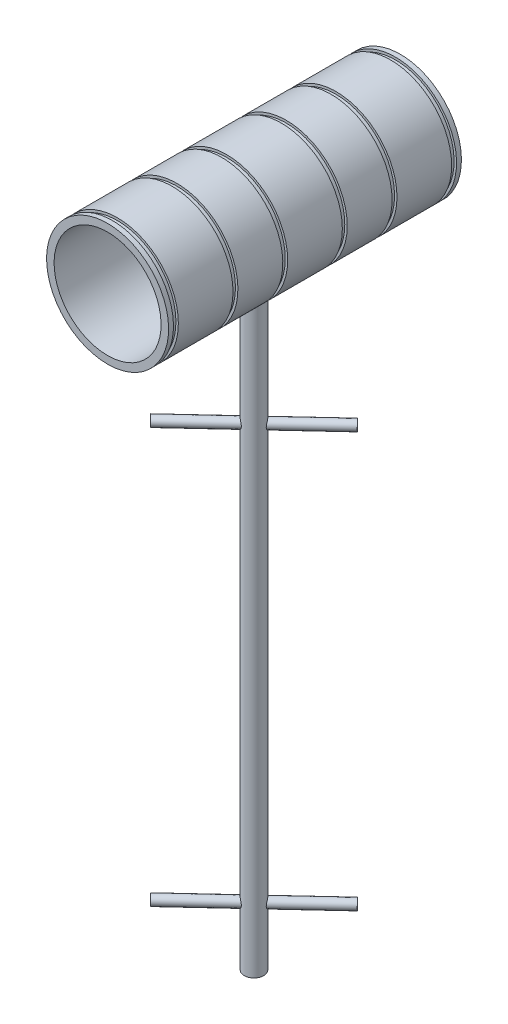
ISO-10303-21;
HEADER;
FILE_DESCRIPTION(('STEP AP214'),'2;1');
FILE_NAME('part.step','',(''),(''),'','','');
FILE_SCHEMA(('AUTOMOTIVE_DESIGN { 1 0 10303 214 1 1 1 1 }'));
ENDSEC;
DATA;
#1=APPLICATION_CONTEXT('core data for automotive mechanical design processes');
#2=APPLICATION_PROTOCOL_DEFINITION('international standard','automotive_design',2000,#1);
#3=PRODUCT_CONTEXT('',#1,'mechanical');
#4=PRODUCT('Part','Part','',(#3));
#5=PRODUCT_RELATED_PRODUCT_CATEGORY('part','',(#4));
#6=PRODUCT_DEFINITION_FORMATION('','',#4);
#7=PRODUCT_DEFINITION_CONTEXT('part definition',#1,'design');
#8=PRODUCT_DEFINITION('design','',#6,#7);
#9=PRODUCT_DEFINITION_SHAPE('','',#8);
#10=(LENGTH_UNIT() NAMED_UNIT(*) SI_UNIT(.MILLI.,.METRE.));
#11=(NAMED_UNIT(*) PLANE_ANGLE_UNIT() SI_UNIT($,.RADIAN.));
#12=(NAMED_UNIT(*) SI_UNIT($,.STERADIAN.) SOLID_ANGLE_UNIT());
#13=UNCERTAINTY_MEASURE_WITH_UNIT(LENGTH_MEASURE(1.E-05),#10,'distance_accuracy_value','');
#14=(GEOMETRIC_REPRESENTATION_CONTEXT(3) GLOBAL_UNCERTAINTY_ASSIGNED_CONTEXT((#13)) GLOBAL_UNIT_ASSIGNED_CONTEXT((#10,
#11,#12)) REPRESENTATION_CONTEXT('',''));
#15=CARTESIAN_POINT('',(0.,0.,0.));
#16=DIRECTION('',(0.,0.,1.));
#17=DIRECTION('',(1.,0.,0.));
#18=AXIS2_PLACEMENT_3D('',#15,#16,#17);
#19=CARTESIAN_POINT('',(0.,0.,27.9999919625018));
#20=DIRECTION('',(0.,0.,1.));
#21=DIRECTION('',(1.,0.,0.));
#22=AXIS2_PLACEMENT_3D('',#19,#20,#21);
#23=CYLINDRICAL_SURFACE('',#22,12.5);
#24=CARTESIAN_POINT('',(0.,0.,16.7999919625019));
#25=DIRECTION('',(0.,0.,1.));
#26=DIRECTION('',(1.,0.,0.));
#27=AXIS2_PLACEMENT_3D('',#24,#25,#26);
#28=CIRCLE('',#27,12.5);
#29=CARTESIAN_POINT('',(12.5,0.,16.7999919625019));
#30=VERTEX_POINT('',#29);
#31=EDGE_CURVE('E19',#30,#30,#28,.F.);
#32=ORIENTED_EDGE('',*,*,#31,.F.);
#33=EDGE_LOOP('',(#32));
#34=FACE_BOUND('',#33,.T.);
#35=CARTESIAN_POINT('',(0.,0.,27.9999919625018));
#36=DIRECTION('',(0.,0.,1.));
#37=DIRECTION('',(1.,0.,0.));
#38=AXIS2_PLACEMENT_3D('',#35,#36,#37);
#39=CIRCLE('',#38,12.5);
#40=CARTESIAN_POINT('',(12.5,0.,27.9999919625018));
#41=VERTEX_POINT('',#40);
#42=EDGE_CURVE('E451',#41,#41,#39,.T.);
#43=ORIENTED_EDGE('',*,*,#42,.F.);
#44=EDGE_LOOP('',(#43));
#45=FACE_BOUND('',#44,.T.);
#46=ADVANCED_FACE('F15',(#34,#45),#23,.T.);
#47=CARTESIAN_POINT('',(13.6976770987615,-13.6976770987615,16.7999919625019));
#48=DIRECTION('',(0.,0.,-1.));
#49=DIRECTION('',(-1.,0.,0.));
#50=AXIS2_PLACEMENT_3D('',#47,#48,#49);
#51=PLANE('',#50);
#52=CARTESIAN_POINT('',(0.,0.,16.7999919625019));
#53=DIRECTION('',(0.,0.,1.));
#54=DIRECTION('',(1.,0.,0.));
#55=AXIS2_PLACEMENT_3D('',#52,#53,#54);
#56=CIRCLE('',#55,12.);
#57=CARTESIAN_POINT('',(12.,0.,16.7999919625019));
#58=VERTEX_POINT('',#57);
#59=EDGE_CURVE('E449',#58,#58,#56,.F.);
#60=ORIENTED_EDGE('',*,*,#59,.F.);
#61=EDGE_LOOP('',(#60));
#62=FACE_BOUND('',#61,.T.);
#63=ORIENTED_EDGE('',*,*,#31,.T.);
#64=EDGE_LOOP('',(#63));
#65=FACE_BOUND('',#64,.T.);
#66=ADVANCED_FACE('F372',(#62,#65),#51,.T.);
#67=CARTESIAN_POINT('',(-13.6976770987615,-13.6976770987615,27.9999919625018));
#68=DIRECTION('',(0.,0.,1.));
#69=DIRECTION('',(1.,0.,0.));
#70=AXIS2_PLACEMENT_3D('',#67,#68,#69);
#71=PLANE('',#70);
#72=CARTESIAN_POINT('',(0.,0.,27.9999919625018));
#73=DIRECTION('',(0.,0.,1.));
#74=DIRECTION('',(0.,-1.,0.));
#75=AXIS2_PLACEMENT_3D('',#72,#73,#74);
#76=CIRCLE('',#75,12.);
#77=CARTESIAN_POINT('',(0.,-12.,27.9999919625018));
#78=VERTEX_POINT('',#77);
#79=EDGE_CURVE('E446',#78,#78,#76,.T.);
#80=ORIENTED_EDGE('',*,*,#79,.F.);
#81=EDGE_LOOP('',(#80));
#82=FACE_BOUND('',#81,.T.);
#83=ORIENTED_EDGE('',*,*,#42,.T.);
#84=EDGE_LOOP('',(#83));
#85=FACE_BOUND('',#84,.T.);
#86=ADVANCED_FACE('F364',(#82,#85),#71,.T.);
#87=CARTESIAN_POINT('',(0.,0.,16.7999919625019));
#88=DIRECTION('',(0.,0.,1.));
#89=DIRECTION('',(1.,0.,0.));
#90=AXIS2_PLACEMENT_3D('',#87,#88,#89);
#91=CYLINDRICAL_SURFACE('',#90,12.);
#92=ORIENTED_EDGE('',*,*,#59,.T.);
#93=EDGE_LOOP('',(#92));
#94=FACE_BOUND('',#93,.T.);
#95=CARTESIAN_POINT('',(0.,0.,15.7999919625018));
#96=DIRECTION('',(0.,0.,1.));
#97=DIRECTION('',(1.,0.,0.));
#98=AXIS2_PLACEMENT_3D('',#95,#96,#97);
#99=CIRCLE('',#98,12.);
#100=CARTESIAN_POINT('',(12.,0.,15.7999919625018));
#101=VERTEX_POINT('',#100);
#102=EDGE_CURVE('E443',#101,#101,#99,.F.);
#103=ORIENTED_EDGE('',*,*,#102,.F.);
#104=EDGE_LOOP('',(#103));
#105=FACE_BOUND('',#104,.T.);
#106=ADVANCED_FACE('F356',(#94,#105),#91,.T.);
#107=CARTESIAN_POINT('',(0.,0.,28.9999919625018));
#108=DIRECTION('',(0.,0.,1.));
#109=DIRECTION('',(0.,-1.,0.));
#110=AXIS2_PLACEMENT_3D('',#107,#108,#109);
#111=CYLINDRICAL_SURFACE('',#110,12.);
#112=CARTESIAN_POINT('',(0.,0.,28.9999919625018));
#113=DIRECTION('',(0.,0.,1.));
#114=DIRECTION('',(0.,-1.,0.));
#115=AXIS2_PLACEMENT_3D('',#112,#113,#114);
#116=CIRCLE('',#115,12.);
#117=CARTESIAN_POINT('',(0.,-12.,28.9999919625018));
#118=VERTEX_POINT('',#117);
#119=EDGE_CURVE('E440',#118,#118,#116,.T.);
#120=ORIENTED_EDGE('',*,*,#119,.F.);
#121=EDGE_LOOP('',(#120));
#122=FACE_BOUND('',#121,.T.);
#123=ORIENTED_EDGE('',*,*,#79,.T.);
#124=EDGE_LOOP('',(#123));
#125=FACE_BOUND('',#124,.T.);
#126=ADVANCED_FACE('F348',(#122,#125),#111,.T.);
#127=CARTESIAN_POINT('',(-13.6976770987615,-13.6976770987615,15.7999919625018));
#128=DIRECTION('',(0.,0.,1.));
#129=DIRECTION('',(1.,0.,0.));
#130=AXIS2_PLACEMENT_3D('',#127,#128,#129);
#131=PLANE('',#130);
#132=ORIENTED_EDGE('',*,*,#102,.T.);
#133=EDGE_LOOP('',(#132));
#134=FACE_BOUND('',#133,.T.);
#135=CARTESIAN_POINT('',(0.,0.,15.7999919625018));
#136=DIRECTION('',(0.,0.,1.));
#137=DIRECTION('',(0.,-1.,0.));
#138=AXIS2_PLACEMENT_3D('',#135,#136,#137);
#139=CIRCLE('',#138,12.5);
#140=CARTESIAN_POINT('',(0.,-12.5,15.7999919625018));
#141=VERTEX_POINT('',#140);
#142=EDGE_CURVE('E437',#141,#141,#139,.F.);
#143=ORIENTED_EDGE('',*,*,#142,.F.);
#144=EDGE_LOOP('',(#143));
#145=FACE_BOUND('',#144,.T.);
#146=ADVANCED_FACE('F340',(#134,#145),#131,.T.);
#147=CARTESIAN_POINT('',(13.6976770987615,-13.6976770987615,28.9999919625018));
#148=DIRECTION('',(0.,0.,-1.));
#149=DIRECTION('',(-1.,0.,0.));
#150=AXIS2_PLACEMENT_3D('',#147,#148,#149);
#151=PLANE('',#150);
#152=ORIENTED_EDGE('',*,*,#119,.T.);
#153=EDGE_LOOP('',(#152));
#154=FACE_BOUND('',#153,.T.);
#155=CARTESIAN_POINT('',(0.,0.,28.9999919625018));
#156=DIRECTION('',(0.,0.,1.));
#157=DIRECTION('',(0.,-1.,0.));
#158=AXIS2_PLACEMENT_3D('',#155,#156,#157);
#159=CIRCLE('',#158,12.5);
#160=CARTESIAN_POINT('',(0.,-12.5,28.9999919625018));
#161=VERTEX_POINT('',#160);
#162=EDGE_CURVE('E434',#161,#161,#159,.T.);
#163=ORIENTED_EDGE('',*,*,#162,.F.);
#164=EDGE_LOOP('',(#163));
#165=FACE_BOUND('',#164,.T.);
#166=ADVANCED_FACE('F332',(#154,#165),#151,.T.);
#167=CARTESIAN_POINT('',(0.,0.,15.7999919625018));
#168=DIRECTION('',(0.,0.,1.));
#169=DIRECTION('',(0.,-1.,0.));
#170=AXIS2_PLACEMENT_3D('',#167,#168,#169);
#171=CYLINDRICAL_SURFACE('',#170,12.5);
#172=CARTESIAN_POINT('',(0.,0.,6.60000000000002));
#173=DIRECTION('',(0.,0.,1.));
#174=DIRECTION('',(0.,-1.,0.));
#175=AXIS2_PLACEMENT_3D('',#172,#173,#174);
#176=CIRCLE('',#175,12.5);
#177=CARTESIAN_POINT('',(0.,-12.5,6.60000000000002));
#178=VERTEX_POINT('',#177);
#179=EDGE_CURVE('E431',#178,#178,#176,.F.);
#180=ORIENTED_EDGE('',*,*,#179,.F.);
#181=EDGE_LOOP('',(#180));
#182=FACE_BOUND('',#181,.T.);
#183=ORIENTED_EDGE('',*,*,#142,.T.);
#184=EDGE_LOOP('',(#183));
#185=FACE_BOUND('',#184,.T.);
#186=ADVANCED_FACE('F324',(#182,#185),#171,.T.);
#187=CARTESIAN_POINT('',(0.,0.,30.));
#188=DIRECTION('',(0.,0.,1.));
#189=DIRECTION('',(0.,-1.,0.));
#190=AXIS2_PLACEMENT_3D('',#187,#188,#189);
#191=CYLINDRICAL_SURFACE('',#190,12.5);
#192=ORIENTED_EDGE('',*,*,#162,.T.);
#193=EDGE_LOOP('',(#192));
#194=FACE_BOUND('',#193,.T.);
#195=CARTESIAN_POINT('',(0.,0.,30.));
#196=DIRECTION('',(0.,0.,1.));
#197=DIRECTION('',(0.,-1.,0.));
#198=AXIS2_PLACEMENT_3D('',#195,#196,#197);
#199=CIRCLE('',#198,12.5);
#200=CARTESIAN_POINT('',(0.,-12.5,30.));
#201=VERTEX_POINT('',#200);
#202=EDGE_CURVE('E428',#201,#201,#199,.T.);
#203=ORIENTED_EDGE('',*,*,#202,.F.);
#204=EDGE_LOOP('',(#203));
#205=FACE_BOUND('',#204,.T.);
#206=ADVANCED_FACE('F316',(#194,#205),#191,.T.);
#207=CARTESIAN_POINT('',(13.6976770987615,-13.6976770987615,6.60000000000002));
#208=DIRECTION('',(0.,0.,-1.));
#209=DIRECTION('',(-1.,0.,0.));
#210=AXIS2_PLACEMENT_3D('',#207,#208,#209);
#211=PLANE('',#210);
#212=CARTESIAN_POINT('',(0.,0.,6.60000000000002));
#213=DIRECTION('',(0.,0.,1.));
#214=DIRECTION('',(1.,0.,0.));
#215=AXIS2_PLACEMENT_3D('',#212,#213,#214);
#216=CIRCLE('',#215,12.);
#217=CARTESIAN_POINT('',(12.,0.,6.60000000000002));
#218=VERTEX_POINT('',#217);
#219=EDGE_CURVE('E425',#218,#218,#216,.F.);
#220=ORIENTED_EDGE('',*,*,#219,.F.);
#221=EDGE_LOOP('',(#220));
#222=FACE_BOUND('',#221,.T.);
#223=ORIENTED_EDGE('',*,*,#179,.T.);
#224=EDGE_LOOP('',(#223));
#225=FACE_BOUND('',#224,.T.);
#226=ADVANCED_FACE('F308',(#222,#225),#211,.T.);
#227=CARTESIAN_POINT('',(-11.8333510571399,-39.1,9.3001394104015));
#228=DIRECTION('',(-0.732596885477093,0.,0.680662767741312));
#229=DIRECTION('',(0.680662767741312,0.,0.732596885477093));
#230=AXIS2_PLACEMENT_3D('',#227,#228,#229);
#231=PLANE('',#230);
#232=CARTESIAN_POINT('',(-11.0846220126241,-38.,10.1059959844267));
#233=DIRECTION('',(-0.732596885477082,0.,0.680662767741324));
#234=DIRECTION('',(0.680662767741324,0.,0.732596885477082));
#235=AXIS2_PLACEMENT_3D('',#232,#233,#234);
#236=CIRCLE('',#235,1.00000000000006);
#237=CARTESIAN_POINT('',(-10.4039592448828,-38.,10.8385928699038));
#238=VERTEX_POINT('',#237);
#239=EDGE_CURVE('E422',#238,#238,#236,.F.);
#240=ORIENTED_EDGE('',*,*,#239,.F.);
#241=EDGE_LOOP('',(#240));
#242=FACE_BOUND('',#241,.T.);
#243=ADVANCED_FACE('F300',(#242),#231,.T.);
#244=CARTESIAN_POINT('',(11.6410388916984,-39.1,-9.50712486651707));
#245=DIRECTION('',(0.732596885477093,0.,-0.680662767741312));
#246=DIRECTION('',(-0.680662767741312,0.,-0.732596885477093));
#247=AXIS2_PLACEMENT_3D('',#244,#245,#246);
#248=PLANE('',#247);
#249=CARTESIAN_POINT('',(10.892309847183,-38.,-10.3129814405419));
#250=DIRECTION('',(-0.732596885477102,0.,0.680662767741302));
#251=DIRECTION('',(0.680662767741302,0.,0.732596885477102));
#252=AXIS2_PLACEMENT_3D('',#249,#250,#251);
#253=CIRCLE('',#252,1.);
#254=CARTESIAN_POINT('',(11.5729726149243,-38.,-9.58038455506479));
#255=VERTEX_POINT('',#254);
#256=EDGE_CURVE('E419',#255,#255,#253,.T.);
#257=ORIENTED_EDGE('',*,*,#256,.F.);
#258=EDGE_LOOP('',(#257));
#259=FACE_BOUND('',#258,.T.);
#260=ADVANCED_FACE('F292',(#259),#248,.T.);
#261=CARTESIAN_POINT('',(-11.8333510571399,-124.1,9.3001394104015));
#262=DIRECTION('',(-0.732596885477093,0.,0.680662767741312));
#263=DIRECTION('',(0.680662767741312,0.,0.732596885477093));
#264=AXIS2_PLACEMENT_3D('',#261,#262,#263);
#265=PLANE('',#264);
#266=CARTESIAN_POINT('',(-11.0846220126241,-123.,10.1059959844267));
#267=DIRECTION('',(-0.732596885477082,0.,0.680662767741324));
#268=DIRECTION('',(0.680662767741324,0.,0.732596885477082));
#269=AXIS2_PLACEMENT_3D('',#266,#267,#268);
#270=CIRCLE('',#269,1.00000000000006);
#271=CARTESIAN_POINT('',(-10.4039592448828,-123.,10.8385928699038));
#272=VERTEX_POINT('',#271);
#273=EDGE_CURVE('E416',#272,#272,#270,.F.);
#274=ORIENTED_EDGE('',*,*,#273,.F.);
#275=EDGE_LOOP('',(#274));
#276=FACE_BOUND('',#275,.T.);
#277=ADVANCED_FACE('F284',(#276),#265,.T.);
#278=CARTESIAN_POINT('',(11.6410388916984,-124.1,-9.50712486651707));
#279=DIRECTION('',(0.732596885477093,0.,-0.680662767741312));
#280=DIRECTION('',(-0.680662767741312,0.,-0.732596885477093));
#281=AXIS2_PLACEMENT_3D('',#278,#279,#280);
#282=PLANE('',#281);
#283=CARTESIAN_POINT('',(10.892309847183,-123.,-10.3129814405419));
#284=DIRECTION('',(-0.732596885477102,0.,0.680662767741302));
#285=DIRECTION('',(0.680662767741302,0.,0.732596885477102));
#286=AXIS2_PLACEMENT_3D('',#283,#284,#285);
#287=CIRCLE('',#286,1.00000000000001);
#288=CARTESIAN_POINT('',(11.5729726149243,-123.,-9.58038455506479));
#289=VERTEX_POINT('',#288);
#290=EDGE_CURVE('E413',#289,#289,#287,.T.);
#291=ORIENTED_EDGE('',*,*,#290,.F.);
#292=EDGE_LOOP('',(#291));
#293=FACE_BOUND('',#292,.T.);
#294=ADVANCED_FACE('F276',(#293),#282,.T.);
#295=CARTESIAN_POINT('',(-13.75,-13.75,30.));
#296=DIRECTION('',(0.,0.,1.));
#297=DIRECTION('',(1.,0.,0.));
#298=AXIS2_PLACEMENT_3D('',#295,#296,#297);
#299=PLANE('',#298);
#300=CARTESIAN_POINT('',(0.,0.,30.));
#301=DIRECTION('',(0.,0.,1.));
#302=DIRECTION('',(0.,-1.,0.));
#303=AXIS2_PLACEMENT_3D('',#300,#301,#302);
#304=CIRCLE('',#303,10.96);
#305=CARTESIAN_POINT('',(0.,-10.96,30.));
#306=VERTEX_POINT('',#305);
#307=EDGE_CURVE('E410',#306,#306,#304,.T.);
#308=ORIENTED_EDGE('',*,*,#307,.F.);
#309=EDGE_LOOP('',(#308));
#310=FACE_BOUND('',#309,.T.);
#311=ORIENTED_EDGE('',*,*,#202,.T.);
#312=EDGE_LOOP('',(#311));
#313=FACE_BOUND('',#312,.T.);
#314=ADVANCED_FACE('F268',(#310,#313),#299,.T.);
#315=CARTESIAN_POINT('',(0.,0.,6.60000000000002));
#316=DIRECTION('',(0.,0.,1.));
#317=DIRECTION('',(1.,0.,0.));
#318=AXIS2_PLACEMENT_3D('',#315,#316,#317);
#319=CYLINDRICAL_SURFACE('',#318,12.);
#320=CARTESIAN_POINT('',(0.,0.,5.59999999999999));
#321=DIRECTION('',(0.,0.,1.));
#322=DIRECTION('',(1.,0.,0.));
#323=AXIS2_PLACEMENT_3D('',#320,#321,#322);
#324=CIRCLE('',#323,12.);
#325=CARTESIAN_POINT('',(12.,0.,5.59999999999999));
#326=VERTEX_POINT('',#325);
#327=EDGE_CURVE('E407',#326,#326,#324,.F.);
#328=ORIENTED_EDGE('',*,*,#327,.F.);
#329=EDGE_LOOP('',(#328));
#330=FACE_BOUND('',#329,.T.);
#331=ORIENTED_EDGE('',*,*,#219,.T.);
#332=EDGE_LOOP('',(#331));
#333=FACE_BOUND('',#332,.T.);
#334=ADVANCED_FACE('F260',(#330,#333),#319,.T.);
#335=CARTESIAN_POINT('',(-2.2,-135.,2.2));
#336=DIRECTION('',(0.,-1.,0.));
#337=DIRECTION('',(0.,0.,-1.));
#338=AXIS2_PLACEMENT_3D('',#335,#336,#337);
#339=PLANE('',#338);
#340=CARTESIAN_POINT('',(0.,-135.,0.));
#341=DIRECTION('',(0.,1.,0.));
#342=DIRECTION('',(0.,0.,1.));
#343=AXIS2_PLACEMENT_3D('',#340,#341,#342);
#344=CIRCLE('',#343,2.);
#345=CARTESIAN_POINT('',(0.,-135.,1.99999999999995));
#346=VERTEX_POINT('',#345);
#347=EDGE_CURVE('E401',#346,#346,#344,.T.);
#348=ORIENTED_EDGE('',*,*,#347,.F.);
#349=EDGE_LOOP('',(#348));
#350=FACE_BOUND('',#349,.T.);
#351=ADVANCED_FACE('F252',(#350),#339,.T.);
#352=CARTESIAN_POINT('',(-11.0846220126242,-38.,10.1059959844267));
#353=DIRECTION('',(-0.732596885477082,0.,0.680662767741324));
#354=DIRECTION('',(0.680662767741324,0.,0.732596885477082));
#355=AXIS2_PLACEMENT_3D('',#352,#353,#354);
#356=CYLINDRICAL_SURFACE('',#355,1.00000000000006);
#357=CARTESIAN_POINT('',(-0.73875471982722,-37.9999999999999,1.85855897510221));
#358=CARTESIAN_POINT('',(-0.738760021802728,-38.0533450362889,1.85855919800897));
#359=CARTESIAN_POINT('',(-0.74318672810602,-38.1067543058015,1.85681616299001));
#360=CARTESIAN_POINT('',(-0.760544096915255,-38.2119862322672,1.84977169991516));
#361=CARTESIAN_POINT('',(-0.773491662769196,-38.2638055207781,1.84446319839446));
#362=CARTESIAN_POINT('',(-0.806840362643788,-38.3641805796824,1.83011850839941));
#363=CARTESIAN_POINT('',(-0.82721047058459,-38.4127489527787,1.82109781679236));
#364=CARTESIAN_POINT('',(-0.874137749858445,-38.50578689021,1.79904226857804));
#365=CARTESIAN_POINT('',(-0.900695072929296,-38.5502563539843,1.7860073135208));
#366=CARTESIAN_POINT('',(-0.960454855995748,-38.6368641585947,1.75463172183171));
#367=CARTESIAN_POINT('',(-0.993966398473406,-38.678688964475,1.73601315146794));
#368=CARTESIAN_POINT('',(-1.06486923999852,-38.7558657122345,1.69344683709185));
#369=CARTESIAN_POINT('',(-1.10226165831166,-38.7912157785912,1.66949755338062));
#370=CARTESIAN_POINT('',(-1.18053960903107,-38.8555102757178,1.61513643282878));
#371=CARTESIAN_POINT('',(-1.221498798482,-38.8842122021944,1.58454156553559));
#372=CARTESIAN_POINT('',(-1.3038946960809,-38.9326317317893,1.51745580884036));
#373=CARTESIAN_POINT('',(-1.34533105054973,-38.9523555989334,1.48096905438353));
#374=CARTESIAN_POINT('',(-1.42364386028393,-38.9808557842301,1.4056892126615));
#375=CARTESIAN_POINT('',(-1.46062818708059,-38.9903471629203,1.36727917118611));
#376=CARTESIAN_POINT('',(-1.53187769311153,-39.0005953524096,1.28694549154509));
#377=CARTESIAN_POINT('',(-1.56614387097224,-39.0013553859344,1.24502315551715));
#378=CARTESIAN_POINT('',(-1.62880175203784,-38.9944837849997,1.16170346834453));
#379=CARTESIAN_POINT('',(-1.65742644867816,-38.9873720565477,1.12043615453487));
#380=CARTESIAN_POINT('',(-1.71073311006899,-38.9659993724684,1.03722489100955));
#381=CARTESIAN_POINT('',(-1.73541440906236,-38.9517372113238,0.99528082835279));
#382=CARTESIAN_POINT('',(-1.78159470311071,-38.9159176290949,0.910145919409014));
#383=CARTESIAN_POINT('',(-1.80291353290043,-38.8940755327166,0.866977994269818));
#384=CARTESIAN_POINT('',(-1.84117381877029,-38.8440014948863,0.782454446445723));
#385=CARTESIAN_POINT('',(-1.85811342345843,-38.8157668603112,0.741099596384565));
#386=CARTESIAN_POINT('',(-1.88964316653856,-38.7500654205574,0.656878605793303));
#387=CARTESIAN_POINT('',(-1.90375629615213,-38.71191813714,0.614363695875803));
#388=CARTESIAN_POINT('',(-1.92768525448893,-38.6292407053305,0.534573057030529));
#389=CARTESIAN_POINT('',(-1.93749656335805,-38.5847039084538,0.497302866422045));
#390=CARTESIAN_POINT('',(-1.95404634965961,-38.4871504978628,0.427844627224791));
#391=CARTESIAN_POINT('',(-1.96057058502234,-38.4337895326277,0.396083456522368));
#392=CARTESIAN_POINT('',(-1.97055027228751,-38.3218490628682,0.343030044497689));
#393=CARTESIAN_POINT('',(-1.9740114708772,-38.2632795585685,0.321718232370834));
#394=CARTESIAN_POINT('',(-1.97835491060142,-38.1502257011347,0.293751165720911));
#395=CARTESIAN_POINT('',(-1.97950121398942,-38.0961202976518,0.285619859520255));
#396=CARTESIAN_POINT('',(-1.98028394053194,-37.9873702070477,0.280155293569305));
#397=CARTESIAN_POINT('',(-1.97992157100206,-37.932725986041,0.282813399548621));
#398=CARTESIAN_POINT('',(-1.97776527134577,-37.8326643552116,0.297461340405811));
#399=CARTESIAN_POINT('',(-1.97618038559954,-37.7870323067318,0.308082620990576));
#400=CARTESIAN_POINT('',(-1.97159208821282,-37.6980179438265,0.336194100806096));
#401=CARTESIAN_POINT('',(-1.96858813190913,-37.6546365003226,0.353686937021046));
#402=CARTESIAN_POINT('',(-1.96054892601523,-37.5679695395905,0.39590209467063));
#403=CARTESIAN_POINT('',(-1.95538666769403,-37.5249015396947,0.421043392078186));
#404=CARTESIAN_POINT('',(-1.94257325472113,-37.4427873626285,0.476680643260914));
#405=CARTESIAN_POINT('',(-1.93492072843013,-37.4037434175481,0.507179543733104));
#406=CARTESIAN_POINT('',(-1.9150860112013,-37.3238521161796,0.577938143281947));
#407=CARTESIAN_POINT('',(-1.90235499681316,-37.2838261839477,0.618975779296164));
#408=CARTESIAN_POINT('',(-1.87210566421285,-37.2105835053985,0.705201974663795));
#409=CARTESIAN_POINT('',(-1.85458439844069,-37.1773709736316,0.750393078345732));
#410=CARTESIAN_POINT('',(-1.81301906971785,-37.1169192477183,0.846069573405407));
#411=CARTESIAN_POINT('',(-1.78865483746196,-37.0901399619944,0.896710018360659));
#412=CARTESIAN_POINT('',(-1.73368685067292,-37.0464050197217,0.998839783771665));
#413=CARTESIAN_POINT('',(-1.70308893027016,-37.0294402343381,1.05032826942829));
#414=CARTESIAN_POINT('',(-1.63924626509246,-37.0074908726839,1.14713120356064));
#415=CARTESIAN_POINT('',(-1.6065268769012,-37.0015236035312,1.19256845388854));
#416=CARTESIAN_POINT('',(-1.53721982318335,-36.998992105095,1.28065953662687));
#417=CARTESIAN_POINT('',(-1.50063440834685,-37.0024224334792,1.3233149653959));
#418=CARTESIAN_POINT('',(-1.42850066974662,-37.0178922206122,1.40068802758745));
#419=CARTESIAN_POINT('',(-1.39316738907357,-37.0291093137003,1.43577491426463));
#420=CARTESIAN_POINT('',(-1.3217294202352,-37.0588695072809,1.50179811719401));
#421=CARTESIAN_POINT('',(-1.28562467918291,-37.0774131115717,1.53273414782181));
#422=CARTESIAN_POINT('',(-1.21330496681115,-37.1216141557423,1.59062164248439));
#423=CARTESIAN_POINT('',(-1.17709961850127,-37.1473931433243,1.61749175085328));
#424=CARTESIAN_POINT('',(-1.1065486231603,-37.2051873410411,1.66655311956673));
#425=CARTESIAN_POINT('',(-1.07220364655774,-37.2372047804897,1.68874270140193));
#426=CARTESIAN_POINT('',(-1.00379139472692,-37.3097643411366,1.7303588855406));
#427=CARTESIAN_POINT('',(-0.970004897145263,-37.3508041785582,1.7493806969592));
#428=CARTESIAN_POINT('',(-0.90766897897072,-37.4385174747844,1.78252259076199));
#429=CARTESIAN_POINT('',(-0.879123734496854,-37.4851953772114,1.7966387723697));
#430=CARTESIAN_POINT('',(-0.827866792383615,-37.58515864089,1.82084444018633));
#431=CARTESIAN_POINT('',(-0.805436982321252,-37.6386346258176,1.83074844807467));
#432=CARTESIAN_POINT('',(-0.769745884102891,-37.7490903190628,1.84604348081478));
#433=CARTESIAN_POINT('',(-0.756459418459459,-37.8060599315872,1.85144690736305));
#434=CARTESIAN_POINT('',(-0.745146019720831,-37.8863318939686,1.85600792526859));
#435=CARTESIAN_POINT('',(-0.742754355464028,-37.9089846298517,1.85696497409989));
#436=CARTESIAN_POINT('',(-0.739557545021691,-37.9544209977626,1.8582404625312));
#437=CARTESIAN_POINT('',(-0.738752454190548,-37.9772046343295,1.85855887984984));
#438=CARTESIAN_POINT('',(-0.73875471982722,-37.9999999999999,1.85855897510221));
#439=B_SPLINE_CURVE_WITH_KNOTS('',3,(#357,#358,#359,#360,#361,#362,#363,#364,#365,#366,#367,
#368,#369,#370,#371,#372,#373,#374,#375,#376,#377,#378,#379,#380,#381,#382,#383,#384,#385,#386,
#387,#388,#389,#390,#391,#392,#393,#394,#395,#396,#397,#398,#399,#400,#401,#402,#403,#404,#405,
#406,#407,#408,#409,#410,#411,#412,#413,#414,#415,#416,#417,#418,#419,#420,#421,#422,#423,#424,
#425,#426,#427,#428,#429,#430,#431,#432,#433,#434,#435,#436,#437,#438),.UNSPECIFIED.,.T.,.F.,(4,
2,2,2,2,2,2,2,2,2,2,2,2,2,2,2,2,2,2,2,2,2,2,2,2,2,2,2,2,2,2,2,2,2,2,2,2,2,2,2,4),(0.,
0.159942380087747,0.320203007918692,0.479801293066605,0.639403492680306,0.808861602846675,
0.978368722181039,1.15332597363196,1.32816096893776,1.48977503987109,1.65132945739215,
1.80281796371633,1.95433201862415,2.11229508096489,2.27032481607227,2.44608930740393,
2.62203803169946,2.80831745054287,2.99424663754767,3.15739095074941,3.32040473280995,
3.46043462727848,3.60051831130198,3.75036765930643,3.90029968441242,4.07571536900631,
4.25123923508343,4.43697433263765,4.62253639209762,4.79051918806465,4.95840472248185,
5.11082132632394,5.26324841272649,5.41840752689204,5.57362218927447,5.74225739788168,
5.91102639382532,6.0866058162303,6.26169980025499,6.33004388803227,6.39839036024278),.UNSPECIFIED.);
#440=CARTESIAN_POINT('',(-0.73875471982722,-37.9999999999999,1.85855897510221));
#441=VERTEX_POINT('',#440);
#442=EDGE_CURVE('E394',#441,#441,#439,.T.);
#443=ORIENTED_EDGE('',*,*,#442,.F.);
#444=EDGE_LOOP('',(#443));
#445=FACE_BOUND('',#444,.T.);
#446=ORIENTED_EDGE('',*,*,#239,.T.);
#447=EDGE_LOOP('',(#446));
#448=FACE_BOUND('',#447,.T.);
#449=ADVANCED_FACE('F244',(#445,#448),#356,.T.);
#450=CARTESIAN_POINT('',(1.04835364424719,-38.,-1.16686765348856));
#451=DIRECTION('',(-0.732596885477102,0.,0.680662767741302));
#452=DIRECTION('',(0.680662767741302,0.,0.732596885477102));
#453=AXIS2_PLACEMENT_3D('',#450,#451,#452);
#454=CYLINDRICAL_SURFACE('',#453,1.);
#455=CARTESIAN_POINT('',(1.90776808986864,-38.,-0.600350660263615));
#456=CARTESIAN_POINT('',(1.90776870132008,-37.946654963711,-0.60035593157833));
#457=CARTESIAN_POINT('',(1.90635527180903,-37.8932456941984,-0.604898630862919));
#458=CARTESIAN_POINT('',(1.90060377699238,-37.7880137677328,-0.622726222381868));
#459=CARTESIAN_POINT('',(1.89625989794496,-37.7361944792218,-0.63602849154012));
#460=CARTESIAN_POINT('',(1.88440157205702,-37.6358194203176,-0.670340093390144));
#461=CARTESIAN_POINT('',(1.87690030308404,-37.5872510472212,-0.691317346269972));
#462=CARTESIAN_POINT('',(1.85834853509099,-37.4942131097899,-0.73973685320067));
#463=CARTESIAN_POINT('',(1.84729794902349,-37.4497436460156,-0.76717926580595));
#464=CARTESIAN_POINT('',(1.82039313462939,-37.3631358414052,-0.829080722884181));
#465=CARTESIAN_POINT('',(1.80428440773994,-37.321311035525,-0.863868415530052));
#466=CARTESIAN_POINT('',(1.76703691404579,-37.2441342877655,-0.937704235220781));
#467=CARTESIAN_POINT('',(1.74589669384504,-37.2087842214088,-0.976753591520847));
#468=CARTESIAN_POINT('',(1.69742751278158,-37.1444897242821,-1.05881032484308));
#469=CARTESIAN_POINT('',(1.66992142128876,-37.1157877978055,-1.10190459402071));
#470=CARTESIAN_POINT('',(1.60906416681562,-37.0673682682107,-1.18900210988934));
#471=CARTESIAN_POINT('',(1.57571710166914,-37.0476444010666,-1.23300470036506));
#472=CARTESIAN_POINT('',(1.50638817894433,-37.0191442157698,-1.31663155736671));
#473=CARTESIAN_POINT('',(1.47079625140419,-37.0096528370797,-1.35633529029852));
#474=CARTESIAN_POINT('',(1.39590870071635,-36.9994046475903,-1.43328882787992));
#475=CARTESIAN_POINT('',(1.35661444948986,-36.9986446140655,-1.47053953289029));
#476=CARTESIAN_POINT('',(1.27811835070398,-37.0055162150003,-1.53914378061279));
#477=CARTESIAN_POINT('',(1.23906329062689,-37.0126279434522,-1.57072014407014));
#478=CARTESIAN_POINT('',(1.15998897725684,-37.0340006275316,-1.62999043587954));
#479=CARTESIAN_POINT('',(1.11996956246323,-37.0482627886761,-1.65768370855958));
#480=CARTESIAN_POINT('',(1.03845374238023,-37.084082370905,-1.70998804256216));
#481=CARTESIAN_POINT('',(0.996966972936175,-37.1059244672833,-1.73441774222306));
#482=CARTESIAN_POINT('',(0.915479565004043,-37.1559985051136,-1.77877855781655));
#483=CARTESIAN_POINT('',(0.875479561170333,-37.1842331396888,-1.79870777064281));
#484=CARTESIAN_POINT('',(0.793799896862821,-37.2499345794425,-1.83633399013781));
#485=CARTESIAN_POINT('',(0.752435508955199,-37.2880818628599,-1.85352949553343));
#486=CARTESIAN_POINT('',(0.674616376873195,-37.3707592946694,-1.88325025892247));
#487=CARTESIAN_POINT('',(0.638166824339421,-37.4152960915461,-1.89577060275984));
#488=CARTESIAN_POINT('',(0.570110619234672,-37.5128495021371,-1.91737373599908));
#489=CARTESIAN_POINT('',(0.538913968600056,-37.5662104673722,-1.92621152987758));
#490=CARTESIAN_POINT('',(0.486736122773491,-37.6781509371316,-1.94005822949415));
#491=CARTESIAN_POINT('',(0.465735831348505,-37.7367204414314,-1.94507430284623));
#492=CARTESIAN_POINT('',(0.438162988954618,-37.8497742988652,-1.95145870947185));
#493=CARTESIAN_POINT('',(0.430137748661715,-37.9038797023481,-1.95319872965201));
#494=CARTESIAN_POINT('',(0.424745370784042,-38.0126297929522,-1.95438042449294));
#495=CARTESIAN_POINT('',(0.427369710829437,-38.0672740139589,-1.95382393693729));
#496=CARTESIAN_POINT('',(0.441819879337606,-38.1673356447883,-1.95059834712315));
#497=CARTESIAN_POINT('',(0.452296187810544,-38.2129676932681,-1.9482381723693));
#498=CARTESIAN_POINT('',(0.479995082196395,-38.3019820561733,-1.94159896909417));
#499=CARTESIAN_POINT('',(0.497220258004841,-38.3453634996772,-1.93731920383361));
#500=CARTESIAN_POINT('',(0.53873150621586,-38.4320304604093,-1.92620324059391));
#501=CARTESIAN_POINT('',(0.563426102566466,-38.4750984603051,-1.91920962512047));
#502=CARTESIAN_POINT('',(0.617972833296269,-38.5572126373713,-1.90234719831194));
#503=CARTESIAN_POINT('',(0.647827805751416,-38.5962565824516,-1.89247680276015));
#504=CARTESIAN_POINT('',(0.716939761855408,-38.6761478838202,-1.8675021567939));
#505=CARTESIAN_POINT('',(0.756932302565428,-38.7161738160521,-1.85179346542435));
#506=CARTESIAN_POINT('',(0.840705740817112,-38.7894164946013,-1.81529702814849));
#507=CARTESIAN_POINT('',(0.884488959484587,-38.8226290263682,-1.79450615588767));
#508=CARTESIAN_POINT('',(0.976856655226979,-38.8830807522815,-1.74603062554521));
#509=CARTESIAN_POINT('',(1.02557226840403,-38.9098600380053,-1.7180152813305));
#510=CARTESIAN_POINT('',(1.12339212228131,-38.9535949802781,-1.65569959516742));
#511=CARTESIAN_POINT('',(1.17249595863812,-38.9705597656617,-1.62140513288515));
#512=CARTESIAN_POINT('',(1.26435197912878,-38.9925091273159,-1.55062967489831));
#513=CARTESIAN_POINT('',(1.30726519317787,-38.9984763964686,-1.51466360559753));
#514=CARTESIAN_POINT('',(1.39003179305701,-39.0010078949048,-1.43907791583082));
#515=CARTESIAN_POINT('',(1.42988693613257,-38.9975775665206,-1.39946042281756));
#516=CARTESIAN_POINT('',(1.50175695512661,-38.9821077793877,-1.32184233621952));
#517=CARTESIAN_POINT('',(1.53415587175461,-38.9708906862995,-1.28402910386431));
#518=CARTESIAN_POINT('',(1.59475771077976,-38.9411304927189,-1.20793794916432));
#519=CARTESIAN_POINT('',(1.62296034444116,-38.9225868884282,-1.16965999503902));
#520=CARTESIAN_POINT('',(1.67538370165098,-38.8783858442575,-1.0932866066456));
#521=CARTESIAN_POINT('',(1.69952399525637,-38.8526068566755,-1.05520674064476));
#522=CARTESIAN_POINT('',(1.74327484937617,-38.7948126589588,-0.981245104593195));
#523=CARTESIAN_POINT('',(1.76288378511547,-38.7627952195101,-0.945364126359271));
#524=CARTESIAN_POINT('',(1.79936651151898,-38.6902356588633,-0.874081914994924));
#525=CARTESIAN_POINT('',(1.81585721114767,-38.6491958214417,-0.838990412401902));
#526=CARTESIAN_POINT('',(1.84433448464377,-38.5614825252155,-0.774390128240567));
#527=CARTESIAN_POINT('',(1.85631747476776,-38.5148046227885,-0.74488579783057));
#528=CARTESIAN_POINT('',(1.87669578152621,-38.4148413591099,-0.691990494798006));
#529=CARTESIAN_POINT('',(1.88492680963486,-38.3613653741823,-0.668894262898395));
#530=CARTESIAN_POINT('',(1.89756099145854,-38.2509096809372,-0.632176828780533));
#531=CARTESIAN_POINT('',(1.90197466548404,-38.1939400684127,-0.61852960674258));
#532=CARTESIAN_POINT('',(1.90569301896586,-38.1136681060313,-0.606911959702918));
#533=CARTESIAN_POINT('',(1.90647194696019,-38.0910153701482,-0.604456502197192));
#534=CARTESIAN_POINT('',(1.9075093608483,-38.0455790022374,-0.601174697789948));
#535=CARTESIAN_POINT('',(1.90776782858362,-38.0227953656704,-0.600348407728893));
#536=CARTESIAN_POINT('',(1.90776808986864,-38.,-0.600350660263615));
#537=B_SPLINE_CURVE_WITH_KNOTS('',3,(#455,#456,#457,#458,#459,#460,#461,#462,#463,#464,#465,
#466,#467,#468,#469,#470,#471,#472,#473,#474,#475,#476,#477,#478,#479,#480,#481,#482,#483,#484,
#485,#486,#487,#488,#489,#490,#491,#492,#493,#494,#495,#496,#497,#498,#499,#500,#501,#502,#503,
#504,#505,#506,#507,#508,#509,#510,#511,#512,#513,#514,#515,#516,#517,#518,#519,#520,#521,#522,
#523,#524,#525,#526,#527,#528,#529,#530,#531,#532,#533,#534,#535,#536),.UNSPECIFIED.,.T.,.F.,(4,
2,2,2,2,2,2,2,2,2,2,2,2,2,2,2,2,2,2,2,2,2,2,2,2,2,2,2,2,2,2,2,2,2,2,2,2,2,2,2,4),(0.,
0.159942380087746,0.320203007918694,0.479801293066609,0.639403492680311,0.808861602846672,
0.978368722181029,1.15332597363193,1.32816096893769,1.489775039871,1.65132945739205,
1.80281796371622,1.95433201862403,2.11229508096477,2.27032481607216,2.44608930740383,
2.62203803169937,2.80831745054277,2.99424663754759,3.15739095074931,3.32040473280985,
3.46043462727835,3.60051831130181,3.75036765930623,3.9002996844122,4.07571536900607,
4.25123923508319,4.43697433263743,4.62253639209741,4.79051918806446,4.95840472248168,
5.11082132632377,5.26324841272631,5.41840752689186,5.57362218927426,5.74225739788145,
5.91102639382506,6.08660581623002,6.2616998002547,6.33004388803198,6.39839036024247),.UNSPECIFIED.);
#538=CARTESIAN_POINT('',(1.90776808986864,-38.,-0.600350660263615));
#539=VERTEX_POINT('',#538);
#540=EDGE_CURVE('E400',#539,#539,#537,.T.);
#541=ORIENTED_EDGE('',*,*,#540,.F.);
#542=EDGE_LOOP('',(#541));
#543=FACE_BOUND('',#542,.T.);
#544=ORIENTED_EDGE('',*,*,#256,.T.);
#545=EDGE_LOOP('',(#544));
#546=FACE_BOUND('',#545,.T.);
#547=ADVANCED_FACE('F236',(#543,#546),#454,.T.);
#548=CARTESIAN_POINT('',(-11.0846220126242,-123.,10.1059959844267));
#549=DIRECTION('',(-0.732596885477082,0.,0.680662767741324));
#550=DIRECTION('',(0.680662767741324,0.,0.732596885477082));
#551=AXIS2_PLACEMENT_3D('',#548,#549,#550);
#552=CYLINDRICAL_SURFACE('',#551,1.00000000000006);
#553=CARTESIAN_POINT('',(-0.738754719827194,-123.,1.85855897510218));
#554=CARTESIAN_POINT('',(-0.738760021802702,-123.053345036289,1.85855919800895));
#555=CARTESIAN_POINT('',(-0.743186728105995,-123.106754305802,1.85681616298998));
#556=CARTESIAN_POINT('',(-0.760544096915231,-123.211986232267,1.84977169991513));
#557=CARTESIAN_POINT('',(-0.773491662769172,-123.263805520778,1.84446319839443));
#558=CARTESIAN_POINT('',(-0.806840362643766,-123.364180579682,1.83011850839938));
#559=CARTESIAN_POINT('',(-0.827210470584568,-123.412748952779,1.82109781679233));
#560=CARTESIAN_POINT('',(-0.874137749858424,-123.50578689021,1.79904226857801));
#561=CARTESIAN_POINT('',(-0.900695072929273,-123.550256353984,1.78600731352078));
#562=CARTESIAN_POINT('',(-0.960454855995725,-123.636864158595,1.75463172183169));
#563=CARTESIAN_POINT('',(-0.993966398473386,-123.678688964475,1.73601315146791));
#564=CARTESIAN_POINT('',(-1.0648692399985,-123.755865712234,1.69344683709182));
#565=CARTESIAN_POINT('',(-1.10226165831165,-123.791215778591,1.66949755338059));
#566=CARTESIAN_POINT('',(-1.18053960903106,-123.855510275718,1.61513643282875));
#567=CARTESIAN_POINT('',(-1.221498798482,-123.884212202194,1.58454156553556));
#568=CARTESIAN_POINT('',(-1.3038946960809,-123.932631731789,1.51745580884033));
#569=CARTESIAN_POINT('',(-1.34533105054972,-123.952355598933,1.4809690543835));
#570=CARTESIAN_POINT('',(-1.42364386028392,-123.98085578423,1.40568921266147));
#571=CARTESIAN_POINT('',(-1.46062818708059,-123.99034716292,1.36727917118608));
#572=CARTESIAN_POINT('',(-1.53187769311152,-124.00059535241,1.28694549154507));
#573=CARTESIAN_POINT('',(-1.56614387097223,-124.001355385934,1.24502315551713));
#574=CARTESIAN_POINT('',(-1.62880175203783,-123.994483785,1.16170346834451));
#575=CARTESIAN_POINT('',(-1.65742644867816,-123.987372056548,1.12043615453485));
#576=CARTESIAN_POINT('',(-1.71073311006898,-123.965999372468,1.03722489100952));
#577=CARTESIAN_POINT('',(-1.73541440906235,-123.951737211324,0.995280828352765));
#578=CARTESIAN_POINT('',(-1.7815947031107,-123.915917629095,0.910145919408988));
#579=CARTESIAN_POINT('',(-1.80291353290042,-123.894075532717,0.866977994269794));
#580=CARTESIAN_POINT('',(-1.84117381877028,-123.844001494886,0.7824544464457));
#581=CARTESIAN_POINT('',(-1.85811342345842,-123.815766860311,0.741099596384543));
#582=CARTESIAN_POINT('',(-1.88964316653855,-123.750065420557,0.656878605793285));
#583=CARTESIAN_POINT('',(-1.90375629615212,-123.71191813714,0.614363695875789));
#584=CARTESIAN_POINT('',(-1.92768525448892,-123.629240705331,0.534573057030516));
#585=CARTESIAN_POINT('',(-1.93749656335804,-123.584703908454,0.497302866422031));
#586=CARTESIAN_POINT('',(-1.95404634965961,-123.487150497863,0.427844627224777));
#587=CARTESIAN_POINT('',(-1.96057058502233,-123.433789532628,0.396083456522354));
#588=CARTESIAN_POINT('',(-1.97055027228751,-123.321849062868,0.343030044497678));
#589=CARTESIAN_POINT('',(-1.9740114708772,-123.263279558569,0.321718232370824));
#590=CARTESIAN_POINT('',(-1.97835491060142,-123.150225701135,0.293751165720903));
#591=CARTESIAN_POINT('',(-1.97950121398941,-123.096120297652,0.285619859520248));
#592=CARTESIAN_POINT('',(-1.98028394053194,-122.987370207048,0.280155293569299));
#593=CARTESIAN_POINT('',(-1.97992157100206,-122.932725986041,0.282813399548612));
#594=CARTESIAN_POINT('',(-1.97776527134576,-122.832664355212,0.297461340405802));
#595=CARTESIAN_POINT('',(-1.97618038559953,-122.787032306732,0.308082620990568));
#596=CARTESIAN_POINT('',(-1.97159208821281,-122.698017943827,0.33619410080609));
#597=CARTESIAN_POINT('',(-1.96858813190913,-122.654636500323,0.353686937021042));
#598=CARTESIAN_POINT('',(-1.96054892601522,-122.567969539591,0.395902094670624));
#599=CARTESIAN_POINT('',(-1.95538666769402,-122.524901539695,0.421043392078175));
#600=CARTESIAN_POINT('',(-1.94257325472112,-122.442787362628,0.476680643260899));
#601=CARTESIAN_POINT('',(-1.93492072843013,-122.403743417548,0.50717954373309));
#602=CARTESIAN_POINT('',(-1.91508601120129,-122.32385211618,0.577938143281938));
#603=CARTESIAN_POINT('',(-1.90235499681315,-122.283826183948,0.618975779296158));
#604=CARTESIAN_POINT('',(-1.87210566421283,-122.210583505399,0.705201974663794));
#605=CARTESIAN_POINT('',(-1.85458439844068,-122.177370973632,0.750393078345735));
#606=CARTESIAN_POINT('',(-1.81301906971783,-122.116919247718,0.846069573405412));
#607=CARTESIAN_POINT('',(-1.78865483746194,-122.090139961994,0.896710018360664));
#608=CARTESIAN_POINT('',(-1.73368685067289,-122.046405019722,0.998839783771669));
#609=CARTESIAN_POINT('',(-1.70308893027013,-122.029440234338,1.05032826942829));
#610=CARTESIAN_POINT('',(-1.63924626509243,-122.007490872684,1.14713120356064));
#611=CARTESIAN_POINT('',(-1.60652687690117,-122.001523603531,1.19256845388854));
#612=CARTESIAN_POINT('',(-1.53721982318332,-121.998992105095,1.28065953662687));
#613=CARTESIAN_POINT('',(-1.50063440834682,-122.002422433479,1.32331496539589));
#614=CARTESIAN_POINT('',(-1.4285006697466,-122.017892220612,1.40068802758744));
#615=CARTESIAN_POINT('',(-1.39316738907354,-122.0291093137,1.43577491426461));
#616=CARTESIAN_POINT('',(-1.32172942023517,-122.058869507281,1.50179811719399));
#617=CARTESIAN_POINT('',(-1.28562467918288,-122.077413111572,1.5327341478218));
#618=CARTESIAN_POINT('',(-1.21330496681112,-122.121614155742,1.59062164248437));
#619=CARTESIAN_POINT('',(-1.17709961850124,-122.147393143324,1.61749175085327));
#620=CARTESIAN_POINT('',(-1.10654862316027,-122.205187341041,1.66655311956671));
#621=CARTESIAN_POINT('',(-1.07220364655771,-122.23720478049,1.68874270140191));
#622=CARTESIAN_POINT('',(-1.00379139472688,-122.309764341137,1.73035888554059));
#623=CARTESIAN_POINT('',(-0.970004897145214,-122.350804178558,1.74938069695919));
#624=CARTESIAN_POINT('',(-0.907668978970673,-122.438517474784,1.78252259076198));
#625=CARTESIAN_POINT('',(-0.879123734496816,-122.485195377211,1.79663877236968));
#626=CARTESIAN_POINT('',(-0.827866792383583,-122.58515864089,1.82084444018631));
#627=CARTESIAN_POINT('',(-0.805436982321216,-122.638634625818,1.83074844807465));
#628=CARTESIAN_POINT('',(-0.769745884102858,-122.749090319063,1.84604348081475));
#629=CARTESIAN_POINT('',(-0.756459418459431,-122.806059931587,1.85144690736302));
#630=CARTESIAN_POINT('',(-0.745146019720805,-122.886331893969,1.85600792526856));
#631=CARTESIAN_POINT('',(-0.742754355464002,-122.908984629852,1.85696497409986));
#632=CARTESIAN_POINT('',(-0.739557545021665,-122.954420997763,1.85824046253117));
#633=CARTESIAN_POINT('',(-0.738752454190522,-122.97720463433,1.85855887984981));
#634=CARTESIAN_POINT('',(-0.738754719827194,-123.,1.85855897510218));
#635=B_SPLINE_CURVE_WITH_KNOTS('',3,(#553,#554,#555,#556,#557,#558,#559,#560,#561,#562,#563,
#564,#565,#566,#567,#568,#569,#570,#571,#572,#573,#574,#575,#576,#577,#578,#579,#580,#581,#582,
#583,#584,#585,#586,#587,#588,#589,#590,#591,#592,#593,#594,#595,#596,#597,#598,#599,#600,#601,
#602,#603,#604,#605,#606,#607,#608,#609,#610,#611,#612,#613,#614,#615,#616,#617,#618,#619,#620,
#621,#622,#623,#624,#625,#626,#627,#628,#629,#630,#631,#632,#633,#634),.UNSPECIFIED.,.T.,.F.,(4,
2,2,2,2,2,2,2,2,2,2,2,2,2,2,2,2,2,2,2,2,2,2,2,2,2,2,2,2,2,2,2,2,2,2,2,2,2,2,2,4),(0.,
0.15994238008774,0.320203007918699,0.47980129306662,0.639403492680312,0.808861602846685,
0.978368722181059,1.15332597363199,1.32816096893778,1.48977503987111,1.65132945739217,
1.80281796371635,1.95433201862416,2.11229508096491,2.27032481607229,2.44608930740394,
2.62203803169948,2.80831745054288,2.99424663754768,3.15739095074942,3.32040473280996,
3.46043462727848,3.60051831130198,3.75036765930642,3.90029968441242,4.07571536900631,
4.25123923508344,4.43697433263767,4.62253639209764,4.79051918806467,4.95840472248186,
5.11082132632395,5.2632484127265,5.41840752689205,5.57362218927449,5.74225739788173,
5.91102639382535,6.08660581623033,6.261699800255,6.33004388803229,6.39839036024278),.UNSPECIFIED.);
#636=CARTESIAN_POINT('',(-0.738754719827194,-123.,1.85855897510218));
#637=VERTEX_POINT('',#636);
#638=EDGE_CURVE('E491',#637,#637,#635,.T.);
#639=ORIENTED_EDGE('',*,*,#638,.F.);
#640=EDGE_LOOP('',(#639));
#641=FACE_BOUND('',#640,.T.);
#642=ORIENTED_EDGE('',*,*,#273,.T.);
#643=EDGE_LOOP('',(#642));
#644=FACE_BOUND('',#643,.T.);
#645=ADVANCED_FACE('F228',(#641,#644),#552,.T.);
#646=CARTESIAN_POINT('',(1.04835364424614,-123.,-1.16686765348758));
#647=DIRECTION('',(-0.732596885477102,0.,0.680662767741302));
#648=DIRECTION('',(0.680662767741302,0.,0.732596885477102));
#649=AXIS2_PLACEMENT_3D('',#646,#647,#648);
#650=CYLINDRICAL_SURFACE('',#649,1.00000000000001);
#651=CARTESIAN_POINT('',(1.90776808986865,-123.,-0.60035066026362));
#652=CARTESIAN_POINT('',(1.90776870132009,-122.946654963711,-0.600355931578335));
#653=CARTESIAN_POINT('',(1.90635527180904,-122.893245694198,-0.604898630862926));
#654=CARTESIAN_POINT('',(1.90060377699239,-122.788013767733,-0.622726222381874));
#655=CARTESIAN_POINT('',(1.89625989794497,-122.736194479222,-0.636028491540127));
#656=CARTESIAN_POINT('',(1.88440157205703,-122.635819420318,-0.670340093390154));
#657=CARTESIAN_POINT('',(1.87690030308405,-122.587251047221,-0.691317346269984));
#658=CARTESIAN_POINT('',(1.858348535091,-122.49421310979,-0.739736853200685));
#659=CARTESIAN_POINT('',(1.8472979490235,-122.449743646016,-0.767179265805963));
#660=CARTESIAN_POINT('',(1.8203931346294,-122.363135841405,-0.829080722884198));
#661=CARTESIAN_POINT('',(1.80428440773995,-122.321311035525,-0.863868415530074));
#662=CARTESIAN_POINT('',(1.76703691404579,-122.244134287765,-0.937704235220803));
#663=CARTESIAN_POINT('',(1.74589669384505,-122.208784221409,-0.976753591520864));
#664=CARTESIAN_POINT('',(1.69742751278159,-122.144489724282,-1.0588103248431));
#665=CARTESIAN_POINT('',(1.66992142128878,-122.115787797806,-1.10190459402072));
#666=CARTESIAN_POINT('',(1.60906416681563,-122.067368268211,-1.18900210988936));
#667=CARTESIAN_POINT('',(1.57571710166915,-122.047644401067,-1.23300470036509));
#668=CARTESIAN_POINT('',(1.50638817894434,-122.01914421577,-1.31663155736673));
#669=CARTESIAN_POINT('',(1.4707962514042,-122.00965283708,-1.35633529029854));
#670=CARTESIAN_POINT('',(1.39590870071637,-121.99940464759,-1.43328882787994));
#671=CARTESIAN_POINT('',(1.35661444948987,-121.998644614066,-1.47053953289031));
#672=CARTESIAN_POINT('',(1.278118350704,-122.005516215,-1.53914378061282));
#673=CARTESIAN_POINT('',(1.23906329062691,-122.012627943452,-1.57072014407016));
#674=CARTESIAN_POINT('',(1.15998897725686,-122.034000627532,-1.62999043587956));
#675=CARTESIAN_POINT('',(1.11996956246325,-122.048262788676,-1.6576837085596));
#676=CARTESIAN_POINT('',(1.03845374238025,-122.084082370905,-1.70998804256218));
#677=CARTESIAN_POINT('',(0.996966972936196,-122.105924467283,-1.73441774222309));
#678=CARTESIAN_POINT('',(0.915479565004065,-122.155998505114,-1.77877855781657));
#679=CARTESIAN_POINT('',(0.875479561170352,-122.184233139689,-1.79870777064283));
#680=CARTESIAN_POINT('',(0.793799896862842,-122.249934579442,-1.83633399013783));
#681=CARTESIAN_POINT('',(0.752435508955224,-122.28808186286,-1.85352949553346));
#682=CARTESIAN_POINT('',(0.674616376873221,-122.370759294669,-1.88325025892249));
#683=CARTESIAN_POINT('',(0.638166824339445,-122.415296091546,-1.89577060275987));
#684=CARTESIAN_POINT('',(0.570110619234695,-122.512849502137,-1.91737373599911));
#685=CARTESIAN_POINT('',(0.538913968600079,-122.566210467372,-1.92621152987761));
#686=CARTESIAN_POINT('',(0.486736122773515,-122.678150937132,-1.94005822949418));
#687=CARTESIAN_POINT('',(0.465735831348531,-122.736720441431,-1.94507430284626));
#688=CARTESIAN_POINT('',(0.438162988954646,-122.849774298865,-1.95145870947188));
#689=CARTESIAN_POINT('',(0.430137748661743,-122.903879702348,-1.95319872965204));
#690=CARTESIAN_POINT('',(0.424745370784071,-123.012629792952,-1.95438042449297));
#691=CARTESIAN_POINT('',(0.427369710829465,-123.067274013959,-1.95382393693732));
#692=CARTESIAN_POINT('',(0.441819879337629,-123.167335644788,-1.95059834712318));
#693=CARTESIAN_POINT('',(0.452296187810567,-123.212967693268,-1.94823817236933));
#694=CARTESIAN_POINT('',(0.479995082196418,-123.301982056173,-1.9415989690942));
#695=CARTESIAN_POINT('',(0.497220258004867,-123.345363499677,-1.93731920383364));
#696=CARTESIAN_POINT('',(0.53873150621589,-123.432030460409,-1.92620324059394));
#697=CARTESIAN_POINT('',(0.563426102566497,-123.475098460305,-1.9192096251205));
#698=CARTESIAN_POINT('',(0.6179728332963,-123.557212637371,-1.90234719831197));
#699=CARTESIAN_POINT('',(0.647827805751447,-123.596256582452,-1.89247680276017));
#700=CARTESIAN_POINT('',(0.716939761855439,-123.67614788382,-1.86750215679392));
#701=CARTESIAN_POINT('',(0.756932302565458,-123.716173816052,-1.85179346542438));
#702=CARTESIAN_POINT('',(0.840705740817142,-123.789416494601,-1.81529702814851));
#703=CARTESIAN_POINT('',(0.884488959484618,-123.822629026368,-1.79450615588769));
#704=CARTESIAN_POINT('',(0.976856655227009,-123.883080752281,-1.74603062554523));
#705=CARTESIAN_POINT('',(1.02557226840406,-123.909860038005,-1.71801528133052));
#706=CARTESIAN_POINT('',(1.12339212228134,-123.953594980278,-1.65569959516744));
#707=CARTESIAN_POINT('',(1.17249595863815,-123.970559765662,-1.62140513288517));
#708=CARTESIAN_POINT('',(1.2643519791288,-123.992509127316,-1.55062967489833));
#709=CARTESIAN_POINT('',(1.30726519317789,-123.998476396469,-1.51466360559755));
#710=CARTESIAN_POINT('',(1.39003179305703,-124.001007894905,-1.43907791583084));
#711=CARTESIAN_POINT('',(1.42988693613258,-123.997577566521,-1.39946042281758));
#712=CARTESIAN_POINT('',(1.50175695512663,-123.982107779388,-1.32184233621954));
#713=CARTESIAN_POINT('',(1.53415587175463,-123.9708906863,-1.28402910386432));
#714=CARTESIAN_POINT('',(1.59475771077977,-123.941130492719,-1.20793794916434));
#715=CARTESIAN_POINT('',(1.62296034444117,-123.922586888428,-1.16965999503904));
#716=CARTESIAN_POINT('',(1.675383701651,-123.878385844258,-1.09328660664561));
#717=CARTESIAN_POINT('',(1.69952399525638,-123.852606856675,-1.05520674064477));
#718=CARTESIAN_POINT('',(1.74327484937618,-123.794812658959,-0.981245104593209));
#719=CARTESIAN_POINT('',(1.76288378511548,-123.76279521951,-0.945364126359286));
#720=CARTESIAN_POINT('',(1.79936651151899,-123.690235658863,-0.874081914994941));
#721=CARTESIAN_POINT('',(1.81585721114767,-123.649195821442,-0.838990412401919));
#722=CARTESIAN_POINT('',(1.84433448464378,-123.561482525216,-0.77439012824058));
#723=CARTESIAN_POINT('',(1.85631747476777,-123.514804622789,-0.744885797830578));
#724=CARTESIAN_POINT('',(1.87669578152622,-123.41484135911,-0.691990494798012));
#725=CARTESIAN_POINT('',(1.88492680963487,-123.361365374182,-0.668894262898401));
#726=CARTESIAN_POINT('',(1.89756099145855,-123.250909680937,-0.632176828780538));
#727=CARTESIAN_POINT('',(1.90197466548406,-123.193940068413,-0.618529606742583));
#728=CARTESIAN_POINT('',(1.90569301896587,-123.113668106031,-0.606911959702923));
#729=CARTESIAN_POINT('',(1.9064719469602,-123.091015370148,-0.604456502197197));
#730=CARTESIAN_POINT('',(1.90750936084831,-123.045579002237,-0.601174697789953));
#731=CARTESIAN_POINT('',(1.90776782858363,-123.02279536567,-0.600348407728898));
#732=CARTESIAN_POINT('',(1.90776808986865,-123.,-0.60035066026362));
#733=B_SPLINE_CURVE_WITH_KNOTS('',3,(#651,#652,#653,#654,#655,#656,#657,#658,#659,#660,#661,
#662,#663,#664,#665,#666,#667,#668,#669,#670,#671,#672,#673,#674,#675,#676,#677,#678,#679,#680,
#681,#682,#683,#684,#685,#686,#687,#688,#689,#690,#691,#692,#693,#694,#695,#696,#697,#698,#699,
#700,#701,#702,#703,#704,#705,#706,#707,#708,#709,#710,#711,#712,#713,#714,#715,#716,#717,#718,
#719,#720,#721,#722,#723,#724,#725,#726,#727,#728,#729,#730,#731,#732),.UNSPECIFIED.,.T.,.F.,(4,
2,2,2,2,2,2,2,2,2,2,2,2,2,2,2,2,2,2,2,2,2,2,2,2,2,2,2,2,2,2,2,2,2,2,2,2,2,2,2,4),(0.,
0.159942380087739,0.320203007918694,0.479801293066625,0.639403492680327,0.808861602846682,
0.978368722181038,1.15332597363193,1.3281609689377,1.48977503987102,1.65132945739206,
1.80281796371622,1.95433201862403,2.11229508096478,2.27032481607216,2.44608930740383,
2.62203803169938,2.80831745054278,2.99424663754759,3.15739095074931,3.32040473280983,
3.46043462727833,3.60051831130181,3.75036765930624,3.90029968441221,4.07571536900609,
4.25123923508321,4.43697433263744,4.62253639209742,4.79051918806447,4.95840472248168,
5.11082132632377,5.26324841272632,5.41840752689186,5.57362218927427,5.74225739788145,
5.91102639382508,6.08660581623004,6.2616998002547,6.330043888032,6.39839036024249),.UNSPECIFIED.);
#734=CARTESIAN_POINT('',(1.90776808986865,-123.,-0.60035066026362));
#735=VERTEX_POINT('',#734);
#736=EDGE_CURVE('E488',#735,#735,#733,.T.);
#737=ORIENTED_EDGE('',*,*,#736,.F.);
#738=EDGE_LOOP('',(#737));
#739=FACE_BOUND('',#738,.T.);
#740=ORIENTED_EDGE('',*,*,#290,.T.);
#741=EDGE_LOOP('',(#740));
#742=FACE_BOUND('',#741,.T.);
#743=ADVANCED_FACE('F220',(#739,#742),#650,.T.);
#744=CARTESIAN_POINT('',(0.,0.,-30.));
#745=DIRECTION('',(0.,0.,1.));
#746=DIRECTION('',(0.,-1.,0.));
#747=AXIS2_PLACEMENT_3D('',#744,#745,#746);
#748=CYLINDRICAL_SURFACE('',#747,10.96);
#749=ORIENTED_EDGE('',*,*,#307,.T.);
#750=EDGE_LOOP('',(#749));
#751=FACE_BOUND('',#750,.T.);
#752=CARTESIAN_POINT('',(0.,0.,-30.));
#753=DIRECTION('',(0.,0.,1.));
#754=DIRECTION('',(0.,-1.,0.));
#755=AXIS2_PLACEMENT_3D('',#752,#753,#754);
#756=CIRCLE('',#755,10.96);
#757=CARTESIAN_POINT('',(0.,-10.96,-30.));
#758=VERTEX_POINT('',#757);
#759=EDGE_CURVE('E487',#758,#758,#756,.T.);
#760=ORIENTED_EDGE('',*,*,#759,.F.);
#761=EDGE_LOOP('',(#760));
#762=FACE_BOUND('',#761,.T.);
#763=ADVANCED_FACE('F213',(#751,#762),#748,.F.);
#764=CARTESIAN_POINT('',(-13.6976770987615,-13.6976770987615,5.59999999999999));
#765=DIRECTION('',(0.,0.,1.));
#766=DIRECTION('',(1.,0.,0.));
#767=AXIS2_PLACEMENT_3D('',#764,#765,#766);
#768=PLANE('',#767);
#769=ORIENTED_EDGE('',*,*,#327,.T.);
#770=EDGE_LOOP('',(#769));
#771=FACE_BOUND('',#770,.T.);
#772=CARTESIAN_POINT('',(0.,0.,5.59999999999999));
#773=DIRECTION('',(0.,0.,1.));
#774=DIRECTION('',(1.,0.,0.));
#775=AXIS2_PLACEMENT_3D('',#772,#773,#774);
#776=CIRCLE('',#775,12.5);
#777=CARTESIAN_POINT('',(12.5,0.,5.59999999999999));
#778=VERTEX_POINT('',#777);
#779=EDGE_CURVE('E70',#778,#778,#776,.F.);
#780=ORIENTED_EDGE('',*,*,#779,.F.);
#781=EDGE_LOOP('',(#780));
#782=FACE_BOUND('',#781,.T.);
#783=ADVANCED_FACE('F206',(#771,#782),#768,.T.);
#784=CARTESIAN_POINT('',(0.,-11.6029964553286,0.));
#785=DIRECTION('',(0.,1.,0.));
#786=DIRECTION('',(0.,0.,1.));
#787=AXIS2_PLACEMENT_3D('',#784,#785,#786);
#788=CYLINDRICAL_SURFACE('',#787,2.);
#789=CARTESIAN_POINT('',(-2.,-12.3389626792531,0.));
#790=CARTESIAN_POINT('',(-1.99999546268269,-12.3389646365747,0.1115667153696));
#791=CARTESIAN_POINT('',(-1.99063305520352,-12.3404922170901,0.223195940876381));
#792=CARTESIAN_POINT('',(-1.95344445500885,-12.3464325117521,0.443326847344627));
#793=CARTESIAN_POINT('',(-1.92560083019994,-12.3508479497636,0.551825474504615));
#794=CARTESIAN_POINT('',(-1.85230972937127,-12.3620513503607,0.762477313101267));
#795=CARTESIAN_POINT('',(-1.8068764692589,-12.3688373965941,0.864635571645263));
#796=CARTESIAN_POINT('',(-1.69973041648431,-12.3840151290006,1.05986648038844));
#797=CARTESIAN_POINT('',(-1.63801962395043,-12.3924066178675,1.15294024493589));
#798=CARTESIAN_POINT('',(-1.4994714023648,-12.409935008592,1.32821893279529));
#799=CARTESIAN_POINT('',(-1.42251498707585,-12.4190774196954,1.41032926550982));
#800=CARTESIAN_POINT('',(-1.25591709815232,-12.4370285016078,1.56052945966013));
#801=CARTESIAN_POINT('',(-1.16627489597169,-12.4458371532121,1.62861851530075));
#802=CARTESIAN_POINT('',(-0.976239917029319,-12.4621862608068,1.7491959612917));
#803=CARTESIAN_POINT('',(-0.875790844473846,-12.4697194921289,1.80159669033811));
#804=CARTESIAN_POINT('',(-0.66737599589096,-12.4826077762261,1.88874693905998));
#805=CARTESIAN_POINT('',(-0.559410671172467,-12.4879629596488,1.92349751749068));
#806=CARTESIAN_POINT('',(-0.340004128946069,-12.4958528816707,1.97407274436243));
#807=CARTESIAN_POINT('',(-0.228600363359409,-12.49841126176,1.99005611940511));
#808=CARTESIAN_POINT('',(-0.00466480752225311,-12.500500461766,2.00313650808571));
#809=CARTESIAN_POINT('',(0.107866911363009,-12.5000314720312,2.00023470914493));
#810=CARTESIAN_POINT('',(0.32977971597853,-12.4961375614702,1.97575151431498));
#811=CARTESIAN_POINT('',(0.439180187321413,-12.4927396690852,1.95434091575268));
#812=CARTESIAN_POINT('',(0.652815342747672,-12.4833998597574,1.89371648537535));
#813=CARTESIAN_POINT('',(0.75704987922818,-12.4774578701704,1.85450214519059));
#814=CARTESIAN_POINT('',(0.957905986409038,-12.4636513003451,1.75921154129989));
#815=CARTESIAN_POINT('',(1.05449329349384,-12.4557786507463,1.70306427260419));
#816=CARTESIAN_POINT('',(1.23693967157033,-12.4389865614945,1.57555357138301));
#817=CARTESIAN_POINT('',(1.32279794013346,-12.4300670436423,1.50418900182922));
#818=CARTESIAN_POINT('',(1.48235721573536,-12.4120565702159,1.34732043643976));
#819=CARTESIAN_POINT('',(1.555911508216,-12.4029648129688,1.2616672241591));
#820=CARTESIAN_POINT('',(1.68762680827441,-12.3857313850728,1.07915724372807));
#821=CARTESIAN_POINT('',(1.74578769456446,-12.3775897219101,0.982300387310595));
#822=CARTESIAN_POINT('',(1.84509031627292,-12.3631781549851,0.779969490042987));
#823=CARTESIAN_POINT('',(1.88621545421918,-12.3569100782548,0.674487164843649));
#824=CARTESIAN_POINT('',(1.95012354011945,-12.3469864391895,0.457989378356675));
#825=CARTESIAN_POINT('',(1.97290796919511,-12.343330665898,0.346974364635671));
#826=CARTESIAN_POINT('',(1.99928349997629,-12.3390860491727,0.123872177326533));
#827=CARTESIAN_POINT('',(2.0030832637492,-12.338463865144,0.0118102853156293));
#828=CARTESIAN_POINT('',(1.99193667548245,-12.3402681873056,-0.211348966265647));
#829=CARTESIAN_POINT('',(1.97699098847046,-12.3426945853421,-0.322446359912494));
#830=CARTESIAN_POINT('',(1.92895527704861,-12.3502919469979,-0.539866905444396));
#831=CARTESIAN_POINT('',(1.89597053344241,-12.3554469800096,-0.646213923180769));
#832=CARTESIAN_POINT('',(1.81290306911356,-12.3679074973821,-0.851870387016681));
#833=CARTESIAN_POINT('',(1.76281939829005,-12.3752131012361,-0.951179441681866));
#834=CARTESIAN_POINT('',(1.64647965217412,-12.3912295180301,-1.14087239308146));
#835=CARTESIAN_POINT('',(1.58008930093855,-12.3999517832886,-1.23117295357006));
#836=CARTESIAN_POINT('',(1.43320604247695,-12.4177848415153,-1.39942606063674));
#837=CARTESIAN_POINT('',(1.35271222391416,-12.426895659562,-1.47737780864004));
#838=CARTESIAN_POINT('',(1.17898475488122,-12.4445842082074,-1.61947729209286));
#839=CARTESIAN_POINT('',(1.08563688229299,-12.4531560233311,-1.68348622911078));
#840=CARTESIAN_POINT('',(0.889391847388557,-12.4687070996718,-1.7949130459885));
#841=CARTESIAN_POINT('',(0.786494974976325,-12.4756864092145,-1.8423314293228));
#842=CARTESIAN_POINT('',(0.574493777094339,-12.4872402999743,-1.91901272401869));
#843=CARTESIAN_POINT('',(0.465416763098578,-12.4918246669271,-1.94834960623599));
#844=CARTESIAN_POINT('',(0.243805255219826,-12.4981133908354,-1.98827383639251));
#845=CARTESIAN_POINT('',(0.13127102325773,-12.4998179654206,-1.99886260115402));
#846=CARTESIAN_POINT('',(-0.0927181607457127,-12.5001523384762,-2.00095179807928));
#847=CARTESIAN_POINT('',(-0.204171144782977,-12.4988162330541,-1.99266389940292));
#848=CARTESIAN_POINT('',(-0.424076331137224,-12.4932886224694,-1.95769116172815));
#849=CARTESIAN_POINT('',(-0.532528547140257,-12.4890971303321,-1.93100640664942));
#850=CARTESIAN_POINT('',(-0.743282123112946,-12.4783277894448,-1.86007617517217));
#851=CARTESIAN_POINT('',(-0.845589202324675,-12.471752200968,-1.81584732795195));
#852=CARTESIAN_POINT('',(-1.0413631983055,-12.4569342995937,-1.71110753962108));
#853=CARTESIAN_POINT('',(-1.13482974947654,-12.4486919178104,-1.65059592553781));
#854=CARTESIAN_POINT('',(-1.31133889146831,-12.4313454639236,-1.51425167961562));
#855=CARTESIAN_POINT('',(-1.39426053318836,-12.4222331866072,-1.4382634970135));
#856=CARTESIAN_POINT('',(-1.54625119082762,-12.4042323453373,-1.27345013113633));
#857=CARTESIAN_POINT('',(-1.61531695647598,-12.3953438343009,-1.18462194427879));
#858=CARTESIAN_POINT('',(-1.73804191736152,-12.3787350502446,-0.995970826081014));
#859=CARTESIAN_POINT('',(-1.79159866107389,-12.3710226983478,-0.896080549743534));
#860=CARTESIAN_POINT('',(-1.88109182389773,-12.35773272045,-0.68864171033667));
#861=CARTESIAN_POINT('',(-1.91704612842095,-12.3521529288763,-0.581101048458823));
#862=CARTESIAN_POINT('',(-1.96235985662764,-12.3450187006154,-0.39426204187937));
#863=CARTESIAN_POINT('',(-1.97645270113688,-12.3427600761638,-0.316104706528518));
#864=CARTESIAN_POINT('',(-1.99527431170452,-12.339731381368,-0.158642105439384));
#865=CARTESIAN_POINT('',(-2.00000322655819,-12.3389612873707,-0.0793368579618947));
#866=CARTESIAN_POINT('',(-2.,-12.3389626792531,0.));
#867=B_SPLINE_CURVE_WITH_KNOTS('',3,(#789,#790,#791,#792,#793,#794,#795,#796,#797,#798,#799,
#800,#801,#802,#803,#804,#805,#806,#807,#808,#809,#810,#811,#812,#813,#814,#815,#816,#817,#818,
#819,#820,#821,#822,#823,#824,#825,#826,#827,#828,#829,#830,#831,#832,#833,#834,#835,#836,#837,
#838,#839,#840,#841,#842,#843,#844,#845,#846,#847,#848,#849,#850,#851,#852,#853,#854,#855,#856,
#857,#858,#859,#860,#861,#862,#863,#864,#865,#866),.UNSPECIFIED.,.T.,.F.,(4,2,2,2,2,2,2,2,2,2,2,
2,2,2,2,2,2,2,2,2,2,2,2,2,2,2,2,2,2,2,2,2,2,2,2,2,2,2,4),(0.,0.334410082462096,0.66913604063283,
1.00359203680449,1.33800695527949,1.6751426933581,2.01229780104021,2.35130309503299,
2.69028805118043,3.02638485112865,3.36246051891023,3.69546762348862,4.0284842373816,
4.36291718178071,4.69737512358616,5.03557384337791,5.37377522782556,5.71230534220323,
6.05080811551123,6.3855820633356,6.72034413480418,7.05317297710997,7.38602031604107,
7.7217061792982,8.05741374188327,8.39632425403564,8.73522448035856,9.07272891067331,
9.41020783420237,9.74392117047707,10.0776329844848,10.4110292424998,10.7444392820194,
11.0813822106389,11.4184040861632,11.7576040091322,12.0964585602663,12.3342666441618,
12.5720709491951),.UNSPECIFIED.);
#868=CARTESIAN_POINT('',(-2.,-12.3389626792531,0.));
#869=VERTEX_POINT('',#868);
#870=EDGE_CURVE('E63',#869,#869,#867,.T.);
#871=ORIENTED_EDGE('',*,*,#870,.F.);
#872=EDGE_LOOP('',(#871));
#873=FACE_BOUND('',#872,.T.);
#874=ORIENTED_EDGE('',*,*,#736,.T.);
#875=EDGE_LOOP('',(#874));
#876=FACE_BOUND('',#875,.T.);
#877=ORIENTED_EDGE('',*,*,#638,.T.);
#878=EDGE_LOOP('',(#877));
#879=FACE_BOUND('',#878,.T.);
#880=ORIENTED_EDGE('',*,*,#540,.T.);
#881=EDGE_LOOP('',(#880));
#882=FACE_BOUND('',#881,.T.);
#883=ORIENTED_EDGE('',*,*,#442,.T.);
#884=EDGE_LOOP('',(#883));
#885=FACE_BOUND('',#884,.T.);
#886=ORIENTED_EDGE('',*,*,#347,.T.);
#887=EDGE_LOOP('',(#886));
#888=FACE_BOUND('',#887,.T.);
#889=ADVANCED_FACE('F72',(#873,#876,#879,#882,#885,#888),#788,.T.);
#890=CARTESIAN_POINT('',(13.75,-13.75,-30.));
#891=DIRECTION('',(0.,0.,-1.));
#892=DIRECTION('',(-1.,0.,0.));
#893=AXIS2_PLACEMENT_3D('',#890,#891,#892);
#894=PLANE('',#893);
#895=ORIENTED_EDGE('',*,*,#759,.T.);
#896=EDGE_LOOP('',(#895));
#897=FACE_BOUND('',#896,.T.);
#898=CARTESIAN_POINT('',(0.,0.,-30.));
#899=DIRECTION('',(0.,0.,1.));
#900=DIRECTION('',(0.,-1.,0.));
#901=AXIS2_PLACEMENT_3D('',#898,#899,#900);
#902=CIRCLE('',#901,12.5);
#903=CARTESIAN_POINT('',(0.,-12.5,-30.));
#904=VERTEX_POINT('',#903);
#905=EDGE_CURVE('E60',#904,#904,#902,.T.);
#906=ORIENTED_EDGE('',*,*,#905,.F.);
#907=EDGE_LOOP('',(#906));
#908=FACE_BOUND('',#907,.T.);
#909=ADVANCED_FACE('F81',(#897,#908),#894,.T.);
#910=CARTESIAN_POINT('',(0.,0.,5.59999999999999));
#911=DIRECTION('',(0.,0.,1.));
#912=DIRECTION('',(1.,0.,0.));
#913=AXIS2_PLACEMENT_3D('',#910,#911,#912);
#914=CYLINDRICAL_SURFACE('',#913,12.5);
#915=ORIENTED_EDGE('',*,*,#870,.T.);
#916=EDGE_LOOP('',(#915));
#917=FACE_BOUND('',#916,.T.);
#918=ORIENTED_EDGE('',*,*,#779,.T.);
#919=EDGE_LOOP('',(#918));
#920=FACE_BOUND('',#919,.T.);
#921=CARTESIAN_POINT('',(0.,0.,-5.6));
#922=DIRECTION('',(0.,0.,1.));
#923=DIRECTION('',(1.,0.,0.));
#924=AXIS2_PLACEMENT_3D('',#921,#922,#923);
#925=CIRCLE('',#924,12.5);
#926=CARTESIAN_POINT('',(12.5,0.,-5.6));
#927=VERTEX_POINT('',#926);
#928=EDGE_CURVE('E57',#927,#927,#925,.F.);
#929=ORIENTED_EDGE('',*,*,#928,.F.);
#930=EDGE_LOOP('',(#929));
#931=FACE_BOUND('',#930,.T.);
#932=ADVANCED_FACE('F76',(#917,#920,#931),#914,.T.);
#933=CARTESIAN_POINT('',(0.,0.,-29.));
#934=DIRECTION('',(0.,0.,1.));
#935=DIRECTION('',(0.,-1.,0.));
#936=AXIS2_PLACEMENT_3D('',#933,#934,#935);
#937=CYLINDRICAL_SURFACE('',#936,12.5);
#938=ORIENTED_EDGE('',*,*,#905,.T.);
#939=EDGE_LOOP('',(#938));
#940=FACE_BOUND('',#939,.T.);
#941=CARTESIAN_POINT('',(0.,0.,-29.));
#942=DIRECTION('',(0.,0.,1.));
#943=DIRECTION('',(0.,-1.,0.));
#944=AXIS2_PLACEMENT_3D('',#941,#942,#943);
#945=CIRCLE('',#944,12.5);
#946=CARTESIAN_POINT('',(0.,-12.5,-29.));
#947=VERTEX_POINT('',#946);
#948=EDGE_CURVE('E54',#947,#947,#945,.T.);
#949=ORIENTED_EDGE('',*,*,#948,.F.);
#950=EDGE_LOOP('',(#949));
#951=FACE_BOUND('',#950,.T.);
#952=ADVANCED_FACE('F80',(#940,#951),#937,.T.);
#953=CARTESIAN_POINT('',(13.6976770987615,-13.6976770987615,-5.6));
#954=DIRECTION('',(0.,0.,-1.));
#955=DIRECTION('',(-1.,0.,0.));
#956=AXIS2_PLACEMENT_3D('',#953,#954,#955);
#957=PLANE('',#956);
#958=CARTESIAN_POINT('',(0.,0.,-5.6));
#959=DIRECTION('',(0.,0.,1.));
#960=DIRECTION('',(1.,0.,0.));
#961=AXIS2_PLACEMENT_3D('',#958,#959,#960);
#962=CIRCLE('',#961,12.);
#963=CARTESIAN_POINT('',(12.,0.,-5.6));
#964=VERTEX_POINT('',#963);
#965=EDGE_CURVE('E51',#964,#964,#962,.F.);
#966=ORIENTED_EDGE('',*,*,#965,.F.);
#967=EDGE_LOOP('',(#966));
#968=FACE_BOUND('',#967,.T.);
#969=ORIENTED_EDGE('',*,*,#928,.T.);
#970=EDGE_LOOP('',(#969));
#971=FACE_BOUND('',#970,.T.);
#972=ADVANCED_FACE('F85',(#968,#971),#957,.T.);
#973=CARTESIAN_POINT('',(-13.6976770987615,-13.6976770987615,-29.));
#974=DIRECTION('',(0.,0.,1.));
#975=DIRECTION('',(1.,0.,0.));
#976=AXIS2_PLACEMENT_3D('',#973,#974,#975);
#977=PLANE('',#976);
#978=CARTESIAN_POINT('',(0.,0.,-29.));
#979=DIRECTION('',(0.,0.,1.));
#980=DIRECTION('',(0.,-1.,0.));
#981=AXIS2_PLACEMENT_3D('',#978,#979,#980);
#982=CIRCLE('',#981,12.);
#983=CARTESIAN_POINT('',(0.,-12.,-29.));
#984=VERTEX_POINT('',#983);
#985=EDGE_CURVE('E48',#984,#984,#982,.T.);
#986=ORIENTED_EDGE('',*,*,#985,.F.);
#987=EDGE_LOOP('',(#986));
#988=FACE_BOUND('',#987,.T.);
#989=ORIENTED_EDGE('',*,*,#948,.T.);
#990=EDGE_LOOP('',(#989));
#991=FACE_BOUND('',#990,.T.);
#992=ADVANCED_FACE('F89',(#988,#991),#977,.T.);
#993=CARTESIAN_POINT('',(0.,0.,-5.6));
#994=DIRECTION('',(0.,0.,1.));
#995=DIRECTION('',(1.,0.,0.));
#996=AXIS2_PLACEMENT_3D('',#993,#994,#995);
#997=CYLINDRICAL_SURFACE('',#996,12.);
#998=ORIENTED_EDGE('',*,*,#965,.T.);
#999=EDGE_LOOP('',(#998));
#1000=FACE_BOUND('',#999,.T.);
#1001=CARTESIAN_POINT('',(0.,0.,-6.60000000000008));
#1002=DIRECTION('',(0.,0.,1.));
#1003=DIRECTION('',(1.,0.,0.));
#1004=AXIS2_PLACEMENT_3D('',#1001,#1002,#1003);
#1005=CIRCLE('',#1004,12.);
#1006=CARTESIAN_POINT('',(12.,0.,-6.60000000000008));
#1007=VERTEX_POINT('',#1006);
#1008=EDGE_CURVE('E45',#1007,#1007,#1005,.F.);
#1009=ORIENTED_EDGE('',*,*,#1008,.F.);
#1010=EDGE_LOOP('',(#1009));
#1011=FACE_BOUND('',#1010,.T.);
#1012=ADVANCED_FACE('F93',(#1000,#1011),#997,.T.);
#1013=CARTESIAN_POINT('',(0.,0.,-28.));
#1014=DIRECTION('',(0.,0.,1.));
#1015=DIRECTION('',(0.,-1.,0.));
#1016=AXIS2_PLACEMENT_3D('',#1013,#1014,#1015);
#1017=CYLINDRICAL_SURFACE('',#1016,12.);
#1018=CARTESIAN_POINT('',(0.,0.,-28.));
#1019=DIRECTION('',(0.,0.,1.));
#1020=DIRECTION('',(0.,-1.,0.));
#1021=AXIS2_PLACEMENT_3D('',#1018,#1019,#1020);
#1022=CIRCLE('',#1021,12.);
#1023=CARTESIAN_POINT('',(0.,-12.,-28.));
#1024=VERTEX_POINT('',#1023);
#1025=EDGE_CURVE('E42',#1024,#1024,#1022,.T.);
#1026=ORIENTED_EDGE('',*,*,#1025,.F.);
#1027=EDGE_LOOP('',(#1026));
#1028=FACE_BOUND('',#1027,.T.);
#1029=ORIENTED_EDGE('',*,*,#985,.T.);
#1030=EDGE_LOOP('',(#1029));
#1031=FACE_BOUND('',#1030,.T.);
#1032=ADVANCED_FACE('F97',(#1028,#1031),#1017,.T.);
#1033=CARTESIAN_POINT('',(-13.6976770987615,-13.6976770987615,-6.60000000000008));
#1034=DIRECTION('',(0.,0.,1.));
#1035=DIRECTION('',(1.,0.,0.));
#1036=AXIS2_PLACEMENT_3D('',#1033,#1034,#1035);
#1037=PLANE('',#1036);
#1038=ORIENTED_EDGE('',*,*,#1008,.T.);
#1039=EDGE_LOOP('',(#1038));
#1040=FACE_BOUND('',#1039,.T.);
#1041=CARTESIAN_POINT('',(0.,0.,-6.60000000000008));
#1042=DIRECTION('',(0.,0.,1.));
#1043=DIRECTION('',(1.,0.,0.));
#1044=AXIS2_PLACEMENT_3D('',#1041,#1042,#1043);
#1045=CIRCLE('',#1044,12.5);
#1046=CARTESIAN_POINT('',(12.5,0.,-6.60000000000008));
#1047=VERTEX_POINT('',#1046);
#1048=EDGE_CURVE('E39',#1047,#1047,#1045,.F.);
#1049=ORIENTED_EDGE('',*,*,#1048,.F.);
#1050=EDGE_LOOP('',(#1049));
#1051=FACE_BOUND('',#1050,.T.);
#1052=ADVANCED_FACE('F101',(#1040,#1051),#1037,.T.);
#1053=CARTESIAN_POINT('',(13.6976770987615,-13.6976770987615,-28.));
#1054=DIRECTION('',(0.,0.,-1.));
#1055=DIRECTION('',(-1.,0.,0.));
#1056=AXIS2_PLACEMENT_3D('',#1053,#1054,#1055);
#1057=PLANE('',#1056);
#1058=ORIENTED_EDGE('',*,*,#1025,.T.);
#1059=EDGE_LOOP('',(#1058));
#1060=FACE_BOUND('',#1059,.T.);
#1061=CARTESIAN_POINT('',(0.,0.,-28.));
#1062=DIRECTION('',(0.,0.,1.));
#1063=DIRECTION('',(1.,0.,0.));
#1064=AXIS2_PLACEMENT_3D('',#1061,#1062,#1063);
#1065=CIRCLE('',#1064,12.5);
#1066=CARTESIAN_POINT('',(12.5,0.,-28.));
#1067=VERTEX_POINT('',#1066);
#1068=EDGE_CURVE('E36',#1067,#1067,#1065,.T.);
#1069=ORIENTED_EDGE('',*,*,#1068,.F.);
#1070=EDGE_LOOP('',(#1069));
#1071=FACE_BOUND('',#1070,.T.);
#1072=ADVANCED_FACE('F105',(#1060,#1071),#1057,.T.);
#1073=CARTESIAN_POINT('',(0.,0.,-6.60000000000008));
#1074=DIRECTION('',(0.,0.,1.));
#1075=DIRECTION('',(1.,0.,0.));
#1076=AXIS2_PLACEMENT_3D('',#1073,#1074,#1075);
#1077=CYLINDRICAL_SURFACE('',#1076,12.5);
#1078=CARTESIAN_POINT('',(0.,0.,-15.8));
#1079=DIRECTION('',(0.,0.,1.));
#1080=DIRECTION('',(1.,0.,0.));
#1081=AXIS2_PLACEMENT_3D('',#1078,#1079,#1080);
#1082=CIRCLE('',#1081,12.5);
#1083=CARTESIAN_POINT('',(12.5,0.,-15.8));
#1084=VERTEX_POINT('',#1083);
#1085=EDGE_CURVE('E33',#1084,#1084,#1082,.F.);
#1086=ORIENTED_EDGE('',*,*,#1085,.F.);
#1087=EDGE_LOOP('',(#1086));
#1088=FACE_BOUND('',#1087,.T.);
#1089=ORIENTED_EDGE('',*,*,#1048,.T.);
#1090=EDGE_LOOP('',(#1089));
#1091=FACE_BOUND('',#1090,.T.);
#1092=ADVANCED_FACE('F109',(#1088,#1091),#1077,.T.);
#1093=CARTESIAN_POINT('',(0.,0.,-16.8));
#1094=DIRECTION('',(0.,0.,1.));
#1095=DIRECTION('',(1.,0.,0.));
#1096=AXIS2_PLACEMENT_3D('',#1093,#1094,#1095);
#1097=CYLINDRICAL_SURFACE('',#1096,12.5);
#1098=CARTESIAN_POINT('',(0.,0.,-16.8));
#1099=DIRECTION('',(0.,0.,1.));
#1100=DIRECTION('',(1.,0.,0.));
#1101=AXIS2_PLACEMENT_3D('',#1098,#1099,#1100);
#1102=CIRCLE('',#1101,12.5);
#1103=CARTESIAN_POINT('',(12.5,0.,-16.8));
#1104=VERTEX_POINT('',#1103);
#1105=EDGE_CURVE('E28',#1104,#1104,#1102,.T.);
#1106=ORIENTED_EDGE('',*,*,#1105,.F.);
#1107=EDGE_LOOP('',(#1106));
#1108=FACE_BOUND('',#1107,.T.);
#1109=ORIENTED_EDGE('',*,*,#1068,.T.);
#1110=EDGE_LOOP('',(#1109));
#1111=FACE_BOUND('',#1110,.T.);
#1112=ADVANCED_FACE('F113',(#1108,#1111),#1097,.T.);
#1113=CARTESIAN_POINT('',(13.6976770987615,-13.6976770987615,-15.8));
#1114=DIRECTION('',(0.,0.,-1.));
#1115=DIRECTION('',(-1.,0.,0.));
#1116=AXIS2_PLACEMENT_3D('',#1113,#1114,#1115);
#1117=PLANE('',#1116);
#1118=CARTESIAN_POINT('',(0.,0.,-15.8));
#1119=DIRECTION('',(0.,0.,1.));
#1120=DIRECTION('',(1.,0.,0.));
#1121=AXIS2_PLACEMENT_3D('',#1118,#1119,#1120);
#1122=CIRCLE('',#1121,12.);
#1123=CARTESIAN_POINT('',(12.,0.,-15.8));
#1124=VERTEX_POINT('',#1123);
#1125=EDGE_CURVE('E23',#1124,#1124,#1122,.F.);
#1126=ORIENTED_EDGE('',*,*,#1125,.F.);
#1127=EDGE_LOOP('',(#1126));
#1128=FACE_BOUND('',#1127,.T.);
#1129=ORIENTED_EDGE('',*,*,#1085,.T.);
#1130=EDGE_LOOP('',(#1129));
#1131=FACE_BOUND('',#1130,.T.);
#1132=ADVANCED_FACE('F117',(#1128,#1131),#1117,.T.);
#1133=CARTESIAN_POINT('',(-13.6976770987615,-13.6976770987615,-16.8));
#1134=DIRECTION('',(0.,0.,1.));
#1135=DIRECTION('',(1.,0.,0.));
#1136=AXIS2_PLACEMENT_3D('',#1133,#1134,#1135);
#1137=PLANE('',#1136);
#1138=CARTESIAN_POINT('',(0.,0.,-16.8));
#1139=DIRECTION('',(0.,0.,1.));
#1140=DIRECTION('',(1.,0.,0.));
#1141=AXIS2_PLACEMENT_3D('',#1138,#1139,#1140);
#1142=CIRCLE('',#1141,12.);
#1143=CARTESIAN_POINT('',(12.,0.,-16.8));
#1144=VERTEX_POINT('',#1143);
#1145=EDGE_CURVE('E10',#1144,#1144,#1142,.T.);
#1146=ORIENTED_EDGE('',*,*,#1145,.F.);
#1147=EDGE_LOOP('',(#1146));
#1148=FACE_BOUND('',#1147,.T.);
#1149=ORIENTED_EDGE('',*,*,#1105,.T.);
#1150=EDGE_LOOP('',(#1149));
#1151=FACE_BOUND('',#1150,.T.);
#1152=ADVANCED_FACE('F120',(#1148,#1151),#1137,.T.);
#1153=CARTESIAN_POINT('',(0.,0.,-15.8));
#1154=DIRECTION('',(0.,0.,1.));
#1155=DIRECTION('',(1.,0.,0.));
#1156=AXIS2_PLACEMENT_3D('',#1153,#1154,#1155);
#1157=CYLINDRICAL_SURFACE('',#1156,12.);
#1158=ORIENTED_EDGE('',*,*,#1145,.T.);
#1159=EDGE_LOOP('',(#1158));
#1160=FACE_BOUND('',#1159,.T.);
#1161=ORIENTED_EDGE('',*,*,#1125,.T.);
#1162=EDGE_LOOP('',(#1161));
#1163=FACE_BOUND('',#1162,.T.);
#1164=ADVANCED_FACE('F17',(#1160,#1163),#1157,.T.);
#1165=CLOSED_SHELL('',(#46,#66,#86,#106,#126,#146,#166,#186,#206,#226,#243,#260,#277,#294,#314,
#334,#351,#449,#547,#645,#743,#763,#783,#889,#909,#932,#952,#972,#992,#1012,#1032,#1052,#1072,
#1092,#1112,#1132,#1152,#1164));
#1166=MANIFOLD_SOLID_BREP('B1',#1165);
#1167=ADVANCED_BREP_SHAPE_REPRESENTATION('',(#18,#1166),#14);
#1168=SHAPE_DEFINITION_REPRESENTATION(#9,#1167);
ENDSEC;
END-ISO-10303-21;
